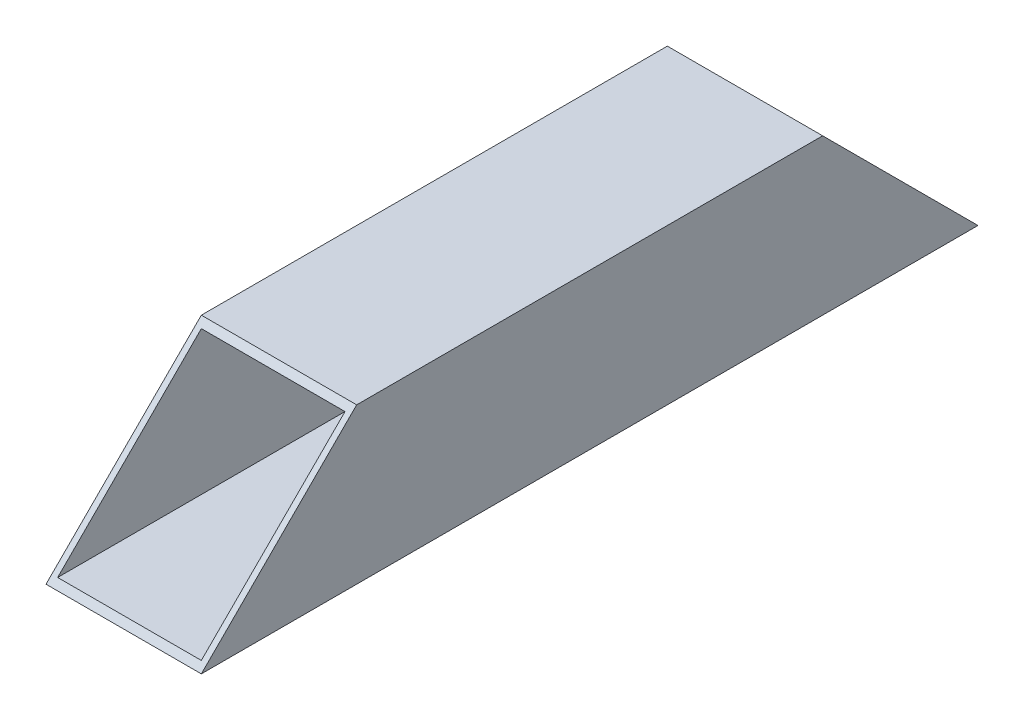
from build123d import *

# Parameters (mm, degrees)
ESQUISSE1_W             = 80
ESQUISSE1_H             = 80
ESQUISSE1_W_2           = 74
ESQUISSE1_H_2           = 74
EXTRUSION1_DEPTH        = 400
ENL_V_MAT_EXTRU_3_DEPTH = 800


with BuildPart() as part:
    # Esquisse1 → Extrusion1 (new body)
    with BuildSketch(Plane.XY):
        with Locations((-40, 40)):
            Rectangle(ESQUISSE1_W, ESQUISSE1_H)
        with Locations((-40, 40)):
            Rectangle(ESQUISSE1_W_2, ESQUISSE1_H_2, mode=Mode.SUBTRACT)
    extrude(amount=EXTRUSION1_DEPTH)

    # Esquisse3 → Enl_v. mat.-Extru.3 (cut)
    with BuildSketch(Plane.ZY.offset(80)):
        Polygon((0, 80), (80, 80), (0, 0), align=None)
        Polygon((400, 80), (320, 80), (400, 0), align=None)
    extrude(amount=-ENL_V_MAT_EXTRU_3_DEPTH, mode=Mode.SUBTRACT)


solid = part.part
